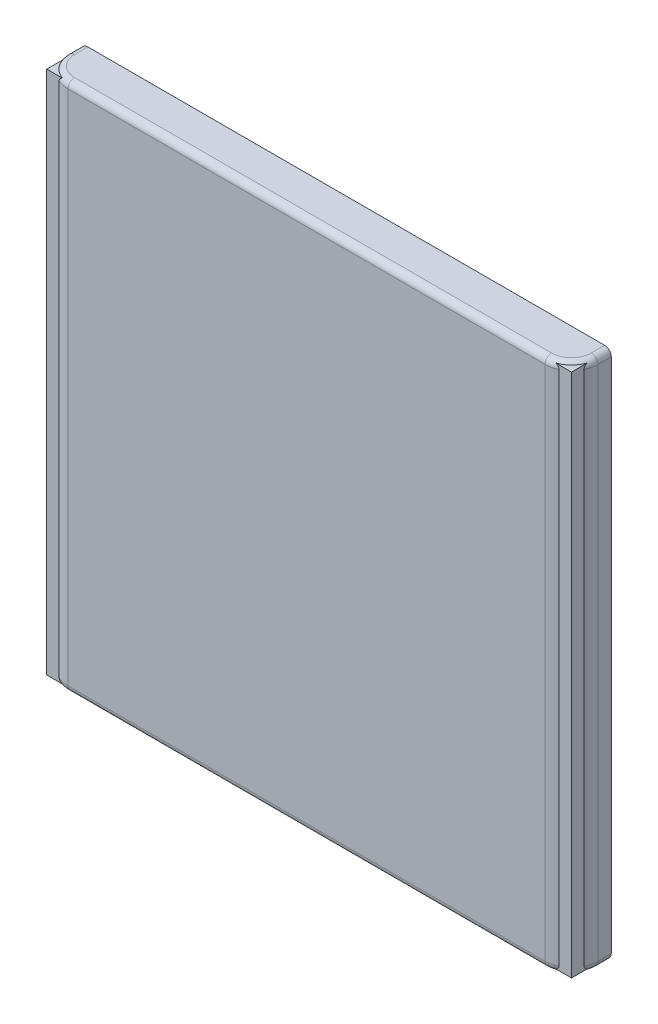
ISO-10303-21;
HEADER;
FILE_DESCRIPTION(('STEP AP214'),'2;1');
FILE_NAME('part.step','',(''),(''),'','','');
FILE_SCHEMA(('AUTOMOTIVE_DESIGN { 1 0 10303 214 1 1 1 1 }'));
ENDSEC;
DATA;
#1=APPLICATION_CONTEXT('core data for automotive mechanical design processes');
#2=APPLICATION_PROTOCOL_DEFINITION('international standard','automotive_design',2000,#1);
#3=PRODUCT_CONTEXT('',#1,'mechanical');
#4=PRODUCT('Part','Part','',(#3));
#5=PRODUCT_RELATED_PRODUCT_CATEGORY('part','',(#4));
#6=PRODUCT_DEFINITION_FORMATION('','',#4);
#7=PRODUCT_DEFINITION_CONTEXT('part definition',#1,'design');
#8=PRODUCT_DEFINITION('design','',#6,#7);
#9=PRODUCT_DEFINITION_SHAPE('','',#8);
#10=(LENGTH_UNIT() NAMED_UNIT(*) SI_UNIT(.MILLI.,.METRE.));
#11=(NAMED_UNIT(*) PLANE_ANGLE_UNIT() SI_UNIT($,.RADIAN.));
#12=(NAMED_UNIT(*) SI_UNIT($,.STERADIAN.) SOLID_ANGLE_UNIT());
#13=UNCERTAINTY_MEASURE_WITH_UNIT(LENGTH_MEASURE(1.E-05),#10,'distance_accuracy_value','');
#14=(GEOMETRIC_REPRESENTATION_CONTEXT(3) GLOBAL_UNCERTAINTY_ASSIGNED_CONTEXT((#13)) GLOBAL_UNIT_ASSIGNED_CONTEXT((#10,
#11,#12)) REPRESENTATION_CONTEXT('',''));
#15=CARTESIAN_POINT('',(0.,0.,0.));
#16=DIRECTION('',(0.,0.,1.));
#17=DIRECTION('',(1.,0.,0.));
#18=AXIS2_PLACEMENT_3D('',#15,#16,#17);
#19=CARTESIAN_POINT('',(0.,0.,0.));
#20=DIRECTION('',(0.,0.,-1.));
#21=DIRECTION('',(-1.,0.,0.));
#22=AXIS2_PLACEMENT_3D('',#19,#20,#21);
#23=PLANE('',#22);
#24=DIRECTION('',(1.,0.,0.));
#25=VECTOR('',#24,1.);
#26=CARTESIAN_POINT('',(0.,0.,0.));
#27=LINE('',#26,#25);
#28=CARTESIAN_POINT('',(5.,0.,0.));
#29=VERTEX_POINT('',#28);
#30=CARTESIAN_POINT('',(395.,0.,0.));
#31=VERTEX_POINT('',#30);
#32=EDGE_CURVE('E192',#29,#31,#27,.T.);
#33=ORIENTED_EDGE('',*,*,#32,.F.);
#34=CARTESIAN_POINT('',(5.,5.,0.));
#35=DIRECTION('',(0.,0.,-1.));
#36=DIRECTION('',(-1.,0.,0.));
#37=AXIS2_PLACEMENT_3D('',#34,#35,#36);
#38=CIRCLE('',#37,5.);
#39=CARTESIAN_POINT('',(0.,5.,0.));
#40=VERTEX_POINT('',#39);
#41=EDGE_CURVE('E247',#29,#40,#38,.T.);
#42=ORIENTED_EDGE('',*,*,#41,.T.);
#43=DIRECTION('',(0.,-1.,0.));
#44=VECTOR('',#43,1.);
#45=CARTESIAN_POINT('',(0.,0.,0.));
#46=LINE('',#45,#44);
#47=CARTESIAN_POINT('',(0.,395.,0.));
#48=VERTEX_POINT('',#47);
#49=EDGE_CURVE('E188',#48,#40,#46,.T.);
#50=ORIENTED_EDGE('',*,*,#49,.F.);
#51=CARTESIAN_POINT('',(5.,395.,0.));
#52=DIRECTION('',(0.,0.,-1.));
#53=DIRECTION('',(-1.,0.,0.));
#54=AXIS2_PLACEMENT_3D('',#51,#52,#53);
#55=CIRCLE('',#54,5.);
#56=CARTESIAN_POINT('',(5.,400.,0.));
#57=VERTEX_POINT('',#56);
#58=EDGE_CURVE('E241',#48,#57,#55,.T.);
#59=ORIENTED_EDGE('',*,*,#58,.T.);
#60=DIRECTION('',(-1.,0.,0.));
#61=VECTOR('',#60,1.);
#62=CARTESIAN_POINT('',(0.,400.,0.));
#63=LINE('',#62,#61);
#64=CARTESIAN_POINT('',(395.,400.,0.));
#65=VERTEX_POINT('',#64);
#66=EDGE_CURVE('E216',#65,#57,#63,.T.);
#67=ORIENTED_EDGE('',*,*,#66,.F.);
#68=CARTESIAN_POINT('',(395.,395.,0.));
#69=DIRECTION('',(0.,0.,-1.));
#70=DIRECTION('',(-1.,0.,0.));
#71=AXIS2_PLACEMENT_3D('',#68,#69,#70);
#72=CIRCLE('',#71,5.);
#73=CARTESIAN_POINT('',(400.,395.,0.));
#74=VERTEX_POINT('',#73);
#75=EDGE_CURVE('E243',#65,#74,#72,.T.);
#76=ORIENTED_EDGE('',*,*,#75,.T.);
#77=DIRECTION('',(0.,1.,0.));
#78=VECTOR('',#77,1.);
#79=CARTESIAN_POINT('',(400.,0.,0.));
#80=LINE('',#79,#78);
#81=CARTESIAN_POINT('',(400.,5.,0.));
#82=VERTEX_POINT('',#81);
#83=EDGE_CURVE('E213',#82,#74,#80,.T.);
#84=ORIENTED_EDGE('',*,*,#83,.F.);
#85=CARTESIAN_POINT('',(395.,5.,0.));
#86=DIRECTION('',(0.,0.,-1.));
#87=DIRECTION('',(-1.,0.,0.));
#88=AXIS2_PLACEMENT_3D('',#85,#86,#87);
#89=CIRCLE('',#88,5.);
#90=EDGE_CURVE('E245',#82,#31,#89,.T.);
#91=ORIENTED_EDGE('',*,*,#90,.T.);
#92=EDGE_LOOP('',(#33,#42,#50,#59,#67,#76,#84,#91));
#93=FACE_BOUND('',#92,.T.);
#94=DIRECTION('',(-1.,0.,0.));
#95=VECTOR('',#94,1.);
#96=CARTESIAN_POINT('',(0.,398.,0.));
#97=LINE('',#96,#95);
#98=CARTESIAN_POINT('',(398.,398.,0.));
#99=VERTEX_POINT('',#98);
#100=CARTESIAN_POINT('',(2.,398.,0.));
#101=VERTEX_POINT('',#100);
#102=EDGE_CURVE('E183',#99,#101,#97,.T.);
#103=ORIENTED_EDGE('',*,*,#102,.T.);
#104=DIRECTION('',(0.,-1.,0.));
#105=VECTOR('',#104,1.);
#106=CARTESIAN_POINT('',(2.,0.,0.));
#107=LINE('',#106,#105);
#108=CARTESIAN_POINT('',(2.,2.,0.));
#109=VERTEX_POINT('',#108);
#110=EDGE_CURVE('E202',#101,#109,#107,.T.);
#111=ORIENTED_EDGE('',*,*,#110,.T.);
#112=DIRECTION('',(1.,0.,0.));
#113=VECTOR('',#112,1.);
#114=CARTESIAN_POINT('',(0.,2.,0.));
#115=LINE('',#114,#113);
#116=CARTESIAN_POINT('',(398.,2.,0.));
#117=VERTEX_POINT('',#116);
#118=EDGE_CURVE('E187',#109,#117,#115,.T.);
#119=ORIENTED_EDGE('',*,*,#118,.T.);
#120=DIRECTION('',(0.,1.,0.));
#121=VECTOR('',#120,1.);
#122=CARTESIAN_POINT('',(398.,0.,0.));
#123=LINE('',#122,#121);
#124=EDGE_CURVE('E207',#117,#99,#123,.T.);
#125=ORIENTED_EDGE('',*,*,#124,.T.);
#126=EDGE_LOOP('',(#103,#111,#119,#125));
#127=FACE_BOUND('',#126,.T.);
#128=ADVANCED_FACE('F49',(#93,#127),#23,.T.);
#129=CARTESIAN_POINT('',(0.,0.,30.));
#130=DIRECTION('',(1.,0.,0.));
#131=DIRECTION('',(0.,0.,-1.));
#132=AXIS2_PLACEMENT_3D('',#129,#130,#131);
#133=PLANE('',#132);
#134=ORIENTED_EDGE('',*,*,#49,.T.);
#135=DIRECTION('',(0.,0.,-1.));
#136=VECTOR('',#135,1.);
#137=CARTESIAN_POINT('',(0.,5.,30.));
#138=LINE('',#137,#136);
#139=CARTESIAN_POINT('',(0.,5.,10.));
#140=VERTEX_POINT('',#139);
#141=EDGE_CURVE('E251',#40,#140,#138,.F.);
#142=ORIENTED_EDGE('',*,*,#141,.T.);
#143=DIRECTION('',(0.,-1.,0.));
#144=VECTOR('',#143,1.);
#145=CARTESIAN_POINT('',(0.,0.,10.));
#146=LINE('',#145,#144);
#147=CARTESIAN_POINT('',(0.,395.,10.));
#148=VERTEX_POINT('',#147);
#149=EDGE_CURVE('E227',#140,#148,#146,.F.);
#150=ORIENTED_EDGE('',*,*,#149,.T.);
#151=DIRECTION('',(0.,0.,-1.));
#152=VECTOR('',#151,1.);
#153=CARTESIAN_POINT('',(0.,395.,30.));
#154=LINE('',#153,#152);
#155=EDGE_CURVE('E249',#148,#48,#154,.T.);
#156=ORIENTED_EDGE('',*,*,#155,.T.);
#157=EDGE_LOOP('',(#134,#142,#150,#156));
#158=FACE_BOUND('',#157,.T.);
#159=ADVANCED_FACE('F306',(#158),#133,.F.);
#160=CARTESIAN_POINT('',(0.,0.,30.));
#161=DIRECTION('',(0.,1.,0.));
#162=DIRECTION('',(0.,0.,1.));
#163=AXIS2_PLACEMENT_3D('',#160,#161,#162);
#164=PLANE('',#163);
#165=CARTESIAN_POINT('',(20.,0.,10.));
#166=DIRECTION('',(0.,1.,0.));
#167=DIRECTION('',(0.,0.,1.));
#168=AXIS2_PLACEMENT_3D('',#165,#166,#167);
#169=CIRCLE('',#168,15.);
#170=CARTESIAN_POINT('',(20.,0.,25.));
#171=VERTEX_POINT('',#170);
#172=CARTESIAN_POINT('',(5.,0.,10.));
#173=VERTEX_POINT('',#172);
#174=EDGE_CURVE('E236',#171,#173,#169,.F.);
#175=ORIENTED_EDGE('',*,*,#174,.T.);
#176=DIRECTION('',(0.,0.,-1.));
#177=VECTOR('',#176,1.);
#178=CARTESIAN_POINT('',(5.,0.,30.));
#179=LINE('',#178,#177);
#180=EDGE_CURVE('E238',#173,#29,#179,.T.);
#181=ORIENTED_EDGE('',*,*,#180,.T.);
#182=ORIENTED_EDGE('',*,*,#32,.T.);
#183=DIRECTION('',(0.,0.,-1.));
#184=VECTOR('',#183,1.);
#185=CARTESIAN_POINT('',(395.,0.,30.));
#186=LINE('',#185,#184);
#187=CARTESIAN_POINT('',(395.,0.,10.));
#188=VERTEX_POINT('',#187);
#189=EDGE_CURVE('E234',#31,#188,#186,.F.);
#190=ORIENTED_EDGE('',*,*,#189,.T.);
#191=CARTESIAN_POINT('',(380.,0.,10.));
#192=DIRECTION('',(0.,1.,0.));
#193=DIRECTION('',(0.,0.,1.));
#194=AXIS2_PLACEMENT_3D('',#191,#192,#193);
#195=CIRCLE('',#194,15.);
#196=CARTESIAN_POINT('',(380.,0.,25.));
#197=VERTEX_POINT('',#196);
#198=EDGE_CURVE('E232',#188,#197,#195,.F.);
#199=ORIENTED_EDGE('',*,*,#198,.T.);
#200=DIRECTION('',(1.,0.,0.));
#201=VECTOR('',#200,1.);
#202=CARTESIAN_POINT('',(0.,0.,25.));
#203=LINE('',#202,#201);
#204=EDGE_CURVE('E230',#197,#171,#203,.F.);
#205=ORIENTED_EDGE('',*,*,#204,.T.);
#206=EDGE_LOOP('',(#175,#181,#182,#190,#199,#205));
#207=FACE_BOUND('',#206,.T.);
#208=ADVANCED_FACE('F317',(#207),#164,.F.);
#209=CARTESIAN_POINT('',(400.,0.,30.));
#210=DIRECTION('',(-1.,0.,0.));
#211=DIRECTION('',(0.,0.,1.));
#212=AXIS2_PLACEMENT_3D('',#209,#210,#211);
#213=PLANE('',#212);
#214=DIRECTION('',(0.,1.,0.));
#215=VECTOR('',#214,1.);
#216=CARTESIAN_POINT('',(400.,0.,10.));
#217=LINE('',#216,#215);
#218=CARTESIAN_POINT('',(400.,395.,10.));
#219=VERTEX_POINT('',#218);
#220=CARTESIAN_POINT('',(400.,5.,10.));
#221=VERTEX_POINT('',#220);
#222=EDGE_CURVE('E224',#219,#221,#217,.F.);
#223=ORIENTED_EDGE('',*,*,#222,.T.);
#224=DIRECTION('',(0.,0.,-1.));
#225=VECTOR('',#224,1.);
#226=CARTESIAN_POINT('',(400.,5.,30.));
#227=LINE('',#226,#225);
#228=EDGE_CURVE('E259',#221,#82,#227,.T.);
#229=ORIENTED_EDGE('',*,*,#228,.T.);
#230=ORIENTED_EDGE('',*,*,#83,.T.);
#231=DIRECTION('',(0.,0.,-1.));
#232=VECTOR('',#231,1.);
#233=CARTESIAN_POINT('',(400.,395.,30.));
#234=LINE('',#233,#232);
#235=EDGE_CURVE('E257',#74,#219,#234,.F.);
#236=ORIENTED_EDGE('',*,*,#235,.T.);
#237=EDGE_LOOP('',(#223,#229,#230,#236));
#238=FACE_BOUND('',#237,.T.);
#239=ADVANCED_FACE('F347',(#238),#213,.F.);
#240=CARTESIAN_POINT('',(0.,400.,30.));
#241=DIRECTION('',(0.,-1.,0.));
#242=DIRECTION('',(0.,0.,-1.));
#243=AXIS2_PLACEMENT_3D('',#240,#241,#242);
#244=PLANE('',#243);
#245=CARTESIAN_POINT('',(380.,400.,10.));
#246=DIRECTION('',(0.,-1.,0.));
#247=DIRECTION('',(0.,0.,-1.));
#248=AXIS2_PLACEMENT_3D('',#245,#246,#247);
#249=CIRCLE('',#248,15.);
#250=CARTESIAN_POINT('',(380.,400.,25.));
#251=VERTEX_POINT('',#250);
#252=CARTESIAN_POINT('',(395.,400.,10.));
#253=VERTEX_POINT('',#252);
#254=EDGE_CURVE('E66',#251,#253,#249,.F.);
#255=ORIENTED_EDGE('',*,*,#254,.T.);
#256=DIRECTION('',(0.,0.,-1.));
#257=VECTOR('',#256,1.);
#258=CARTESIAN_POINT('',(395.,400.,30.));
#259=LINE('',#258,#257);
#260=EDGE_CURVE('E271',#253,#65,#259,.T.);
#261=ORIENTED_EDGE('',*,*,#260,.T.);
#262=ORIENTED_EDGE('',*,*,#66,.T.);
#263=DIRECTION('',(0.,0.,-1.));
#264=VECTOR('',#263,1.);
#265=CARTESIAN_POINT('',(5.,400.,30.));
#266=LINE('',#265,#264);
#267=CARTESIAN_POINT('',(5.,400.,10.));
#268=VERTEX_POINT('',#267);
#269=EDGE_CURVE('E73',#57,#268,#266,.F.);
#270=ORIENTED_EDGE('',*,*,#269,.T.);
#271=CARTESIAN_POINT('',(20.,400.,10.));
#272=DIRECTION('',(0.,-1.,0.));
#273=DIRECTION('',(0.,0.,-1.));
#274=AXIS2_PLACEMENT_3D('',#271,#272,#273);
#275=CIRCLE('',#274,15.);
#276=CARTESIAN_POINT('',(20.,400.,25.));
#277=VERTEX_POINT('',#276);
#278=EDGE_CURVE('E267',#268,#277,#275,.F.);
#279=ORIENTED_EDGE('',*,*,#278,.T.);
#280=DIRECTION('',(-1.,0.,0.));
#281=VECTOR('',#280,1.);
#282=CARTESIAN_POINT('',(0.,400.,25.));
#283=LINE('',#282,#281);
#284=EDGE_CURVE('E265',#277,#251,#283,.F.);
#285=ORIENTED_EDGE('',*,*,#284,.T.);
#286=EDGE_LOOP('',(#255,#261,#262,#270,#279,#285));
#287=FACE_BOUND('',#286,.T.);
#288=ADVANCED_FACE('F360',(#287),#244,.F.);
#289=CARTESIAN_POINT('',(0.,0.,30.));
#290=DIRECTION('',(0.,0.,-1.));
#291=DIRECTION('',(-1.,0.,0.));
#292=AXIS2_PLACEMENT_3D('',#289,#290,#291);
#293=PLANE('',#292);
#294=DIRECTION('',(0.,-1.,0.));
#295=VECTOR('',#294,1.);
#296=CARTESIAN_POINT('',(20.,0.,30.));
#297=LINE('',#296,#295);
#298=CARTESIAN_POINT('',(20.,395.,30.));
#299=VERTEX_POINT('',#298);
#300=CARTESIAN_POINT('',(20.,5.,30.));
#301=VERTEX_POINT('',#300);
#302=EDGE_CURVE('E218',#299,#301,#297,.T.);
#303=ORIENTED_EDGE('',*,*,#302,.T.);
#304=DIRECTION('',(1.,0.,0.));
#305=VECTOR('',#304,1.);
#306=CARTESIAN_POINT('',(0.,5.,30.));
#307=LINE('',#306,#305);
#308=CARTESIAN_POINT('',(380.,5.,30.));
#309=VERTEX_POINT('',#308);
#310=EDGE_CURVE('E11',#301,#309,#307,.T.);
#311=ORIENTED_EDGE('',*,*,#310,.T.);
#312=DIRECTION('',(0.,1.,0.));
#313=VECTOR('',#312,1.);
#314=CARTESIAN_POINT('',(380.,0.,30.));
#315=LINE('',#314,#313);
#316=CARTESIAN_POINT('',(380.,395.,30.));
#317=VERTEX_POINT('',#316);
#318=EDGE_CURVE('E221',#309,#317,#315,.T.);
#319=ORIENTED_EDGE('',*,*,#318,.T.);
#320=DIRECTION('',(-1.,0.,0.));
#321=VECTOR('',#320,1.);
#322=CARTESIAN_POINT('',(0.,395.,30.));
#323=LINE('',#322,#321);
#324=EDGE_CURVE('E58',#317,#299,#323,.T.);
#325=ORIENTED_EDGE('',*,*,#324,.T.);
#326=EDGE_LOOP('',(#303,#311,#319,#325));
#327=FACE_BOUND('',#326,.T.);
#328=ADVANCED_FACE('F331',(#327),#293,.F.);
#329=CARTESIAN_POINT('',(2.,0.,30.));
#330=DIRECTION('',(1.,0.,0.));
#331=DIRECTION('',(0.,0.,-1.));
#332=AXIS2_PLACEMENT_3D('',#329,#330,#331);
#333=PLANE('',#332);
#334=ORIENTED_EDGE('',*,*,#110,.F.);
#335=DIRECTION('',(0.,0.,-1.));
#336=VECTOR('',#335,1.);
#337=CARTESIAN_POINT('',(2.,398.,30.));
#338=LINE('',#337,#336);
#339=CARTESIAN_POINT('',(2.,398.,28.));
#340=VERTEX_POINT('',#339);
#341=EDGE_CURVE('E182',#340,#101,#338,.T.);
#342=ORIENTED_EDGE('',*,*,#341,.F.);
#343=DIRECTION('',(0.,-1.,0.));
#344=VECTOR('',#343,1.);
#345=CARTESIAN_POINT('',(2.,0.,28.));
#346=LINE('',#345,#344);
#347=CARTESIAN_POINT('',(2.,2.,28.));
#348=VERTEX_POINT('',#347);
#349=EDGE_CURVE('E168',#340,#348,#346,.T.);
#350=ORIENTED_EDGE('',*,*,#349,.T.);
#351=DIRECTION('',(0.,0.,-1.));
#352=VECTOR('',#351,1.);
#353=CARTESIAN_POINT('',(2.,2.,30.));
#354=LINE('',#353,#352);
#355=EDGE_CURVE('E180',#348,#109,#354,.T.);
#356=ORIENTED_EDGE('',*,*,#355,.T.);
#357=EDGE_LOOP('',(#334,#342,#350,#356));
#358=FACE_BOUND('',#357,.T.);
#359=ADVANCED_FACE('F179',(#358),#333,.T.);
#360=CARTESIAN_POINT('',(0.,2.,30.));
#361=DIRECTION('',(0.,1.,0.));
#362=DIRECTION('',(0.,0.,1.));
#363=AXIS2_PLACEMENT_3D('',#360,#361,#362);
#364=PLANE('',#363);
#365=ORIENTED_EDGE('',*,*,#118,.F.);
#366=ORIENTED_EDGE('',*,*,#355,.F.);
#367=DIRECTION('',(1.,0.,0.));
#368=VECTOR('',#367,1.);
#369=CARTESIAN_POINT('',(0.,2.,28.));
#370=LINE('',#369,#368);
#371=CARTESIAN_POINT('',(398.,2.,28.));
#372=VERTEX_POINT('',#371);
#373=EDGE_CURVE('E164',#348,#372,#370,.T.);
#374=ORIENTED_EDGE('',*,*,#373,.T.);
#375=DIRECTION('',(0.,0.,-1.));
#376=VECTOR('',#375,1.);
#377=CARTESIAN_POINT('',(398.,2.,30.));
#378=LINE('',#377,#376);
#379=EDGE_CURVE('E189',#372,#117,#378,.T.);
#380=ORIENTED_EDGE('',*,*,#379,.T.);
#381=EDGE_LOOP('',(#365,#366,#374,#380));
#382=FACE_BOUND('',#381,.T.);
#383=ADVANCED_FACE('F185',(#382),#364,.T.);
#384=CARTESIAN_POINT('',(398.,0.,30.));
#385=DIRECTION('',(-1.,0.,0.));
#386=DIRECTION('',(0.,0.,1.));
#387=AXIS2_PLACEMENT_3D('',#384,#385,#386);
#388=PLANE('',#387);
#389=ORIENTED_EDGE('',*,*,#124,.F.);
#390=ORIENTED_EDGE('',*,*,#379,.F.);
#391=DIRECTION('',(0.,1.,0.));
#392=VECTOR('',#391,1.);
#393=CARTESIAN_POINT('',(398.,0.,28.));
#394=LINE('',#393,#392);
#395=CARTESIAN_POINT('',(398.,398.,28.));
#396=VERTEX_POINT('',#395);
#397=EDGE_CURVE('E169',#372,#396,#394,.T.);
#398=ORIENTED_EDGE('',*,*,#397,.T.);
#399=DIRECTION('',(0.,0.,-1.));
#400=VECTOR('',#399,1.);
#401=CARTESIAN_POINT('',(398.,398.,30.));
#402=LINE('',#401,#400);
#403=EDGE_CURVE('E194',#396,#99,#402,.T.);
#404=ORIENTED_EDGE('',*,*,#403,.T.);
#405=EDGE_LOOP('',(#389,#390,#398,#404));
#406=FACE_BOUND('',#405,.T.);
#407=ADVANCED_FACE('F381',(#406),#388,.T.);
#408=CARTESIAN_POINT('',(0.,398.,30.));
#409=DIRECTION('',(0.,-1.,0.));
#410=DIRECTION('',(0.,0.,-1.));
#411=AXIS2_PLACEMENT_3D('',#408,#409,#410);
#412=PLANE('',#411);
#413=ORIENTED_EDGE('',*,*,#102,.F.);
#414=ORIENTED_EDGE('',*,*,#403,.F.);
#415=DIRECTION('',(-1.,0.,0.));
#416=VECTOR('',#415,1.);
#417=CARTESIAN_POINT('',(0.,398.,28.));
#418=LINE('',#417,#416);
#419=EDGE_CURVE('E197',#396,#340,#418,.T.);
#420=ORIENTED_EDGE('',*,*,#419,.T.);
#421=ORIENTED_EDGE('',*,*,#341,.T.);
#422=EDGE_LOOP('',(#413,#414,#420,#421));
#423=FACE_BOUND('',#422,.T.);
#424=ADVANCED_FACE('F378',(#423),#412,.T.);
#425=CARTESIAN_POINT('',(0.,0.,28.));
#426=DIRECTION('',(0.,0.,-1.));
#427=DIRECTION('',(-1.,0.,0.));
#428=AXIS2_PLACEMENT_3D('',#425,#426,#427);
#429=PLANE('',#428);
#430=ORIENTED_EDGE('',*,*,#349,.F.);
#431=ORIENTED_EDGE('',*,*,#419,.F.);
#432=ORIENTED_EDGE('',*,*,#397,.F.);
#433=ORIENTED_EDGE('',*,*,#373,.F.);
#434=EDGE_LOOP('',(#430,#431,#432,#433));
#435=FACE_BOUND('',#434,.T.);
#436=ADVANCED_FACE('F166',(#435),#429,.T.);
#437=CARTESIAN_POINT('',(380.,0.,10.));
#438=DIRECTION('',(0.,1.,0.));
#439=DIRECTION('',(0.,0.,1.));
#440=AXIS2_PLACEMENT_3D('',#437,#438,#439);
#441=CYLINDRICAL_SURFACE('',#440,20.);
#442=ORIENTED_EDGE('',*,*,#318,.F.);
#443=CARTESIAN_POINT('',(380.,5.,10.));
#444=DIRECTION('',(0.,1.,0.));
#445=DIRECTION('',(0.,0.,1.));
#446=AXIS2_PLACEMENT_3D('',#443,#444,#445);
#447=CIRCLE('',#446,20.);
#448=EDGE_CURVE('E263',#309,#221,#447,.T.);
#449=ORIENTED_EDGE('',*,*,#448,.T.);
#450=ORIENTED_EDGE('',*,*,#222,.F.);
#451=CARTESIAN_POINT('',(380.,395.,10.));
#452=DIRECTION('',(0.,-1.,0.));
#453=DIRECTION('',(0.,0.,-1.));
#454=AXIS2_PLACEMENT_3D('',#451,#452,#453);
#455=CIRCLE('',#454,20.);
#456=EDGE_CURVE('E261',#219,#317,#455,.T.);
#457=ORIENTED_EDGE('',*,*,#456,.T.);
#458=EDGE_LOOP('',(#442,#449,#450,#457));
#459=FACE_BOUND('',#458,.T.);
#460=ADVANCED_FACE('F343',(#459),#441,.T.);
#461=CARTESIAN_POINT('',(20.,0.,10.));
#462=DIRECTION('',(0.,-1.,0.));
#463=DIRECTION('',(0.,0.,-1.));
#464=AXIS2_PLACEMENT_3D('',#461,#462,#463);
#465=CYLINDRICAL_SURFACE('',#464,20.);
#466=ORIENTED_EDGE('',*,*,#149,.F.);
#467=CARTESIAN_POINT('',(20.,5.,10.));
#468=DIRECTION('',(0.,1.,0.));
#469=DIRECTION('',(0.,0.,1.));
#470=AXIS2_PLACEMENT_3D('',#467,#468,#469);
#471=CIRCLE('',#470,20.);
#472=EDGE_CURVE('E255',#140,#301,#471,.T.);
#473=ORIENTED_EDGE('',*,*,#472,.T.);
#474=ORIENTED_EDGE('',*,*,#302,.F.);
#475=CARTESIAN_POINT('',(20.,395.,10.));
#476=DIRECTION('',(0.,-1.,0.));
#477=DIRECTION('',(0.,0.,-1.));
#478=AXIS2_PLACEMENT_3D('',#475,#476,#477);
#479=CIRCLE('',#478,20.);
#480=EDGE_CURVE('E253',#299,#148,#479,.T.);
#481=ORIENTED_EDGE('',*,*,#480,.T.);
#482=EDGE_LOOP('',(#466,#473,#474,#481));
#483=FACE_BOUND('',#482,.T.);
#484=ADVANCED_FACE('F328',(#483),#465,.T.);
#485=CARTESIAN_POINT('',(395.,5.,30.));
#486=DIRECTION('',(0.,0.,-1.));
#487=DIRECTION('',(-1.,0.,0.));
#488=AXIS2_PLACEMENT_3D('',#485,#486,#487);
#489=CYLINDRICAL_SURFACE('',#488,5.);
#490=ORIENTED_EDGE('',*,*,#90,.F.);
#491=ORIENTED_EDGE('',*,*,#228,.F.);
#492=CARTESIAN_POINT('',(395.,5.,10.));
#493=DIRECTION('',(0.,0.,1.));
#494=DIRECTION('',(1.,0.,0.));
#495=AXIS2_PLACEMENT_3D('',#492,#493,#494);
#496=CIRCLE('',#495,5.);
#497=EDGE_CURVE('E204',#188,#221,#496,.T.);
#498=ORIENTED_EDGE('',*,*,#497,.F.);
#499=ORIENTED_EDGE('',*,*,#189,.F.);
#500=EDGE_LOOP('',(#490,#491,#498,#499));
#501=FACE_BOUND('',#500,.T.);
#502=ADVANCED_FACE('F352',(#501),#489,.T.);
#503=CARTESIAN_POINT('',(380.,5.,10.));
#504=DIRECTION('',(0.,1.,0.));
#505=DIRECTION('',(0.,0.,1.));
#506=AXIS2_PLACEMENT_3D('',#503,#504,#505);
#507=TOROIDAL_SURFACE('',#506,15.,5.);
#508=ORIENTED_EDGE('',*,*,#497,.T.);
#509=ORIENTED_EDGE('',*,*,#448,.F.);
#510=CARTESIAN_POINT('',(380.,5.,25.));
#511=DIRECTION('',(-1.,0.,0.));
#512=DIRECTION('',(0.,0.,1.));
#513=AXIS2_PLACEMENT_3D('',#510,#511,#512);
#514=CIRCLE('',#513,5.);
#515=EDGE_CURVE('E280',#197,#309,#514,.T.);
#516=ORIENTED_EDGE('',*,*,#515,.F.);
#517=ORIENTED_EDGE('',*,*,#198,.F.);
#518=EDGE_LOOP('',(#508,#509,#516,#517));
#519=FACE_BOUND('',#518,.T.);
#520=ADVANCED_FACE('F339',(#519),#507,.T.);
#521=CARTESIAN_POINT('',(0.,5.,25.));
#522=DIRECTION('',(1.,0.,0.));
#523=DIRECTION('',(0.,0.,-1.));
#524=AXIS2_PLACEMENT_3D('',#521,#522,#523);
#525=CYLINDRICAL_SURFACE('',#524,5.);
#526=ORIENTED_EDGE('',*,*,#515,.T.);
#527=ORIENTED_EDGE('',*,*,#310,.F.);
#528=CARTESIAN_POINT('',(20.,5.,25.));
#529=DIRECTION('',(-1.,0.,0.));
#530=DIRECTION('',(0.,0.,1.));
#531=AXIS2_PLACEMENT_3D('',#528,#529,#530);
#532=CIRCLE('',#531,5.);
#533=EDGE_CURVE('E277',#171,#301,#532,.T.);
#534=ORIENTED_EDGE('',*,*,#533,.F.);
#535=ORIENTED_EDGE('',*,*,#204,.F.);
#536=EDGE_LOOP('',(#526,#527,#534,#535));
#537=FACE_BOUND('',#536,.T.);
#538=ADVANCED_FACE('F334',(#537),#525,.T.);
#539=CARTESIAN_POINT('',(20.,5.,10.));
#540=DIRECTION('',(0.,1.,0.));
#541=DIRECTION('',(0.,0.,1.));
#542=AXIS2_PLACEMENT_3D('',#539,#540,#541);
#543=TOROIDAL_SURFACE('',#542,15.,5.);
#544=ORIENTED_EDGE('',*,*,#533,.T.);
#545=ORIENTED_EDGE('',*,*,#472,.F.);
#546=CARTESIAN_POINT('',(5.,5.,10.));
#547=DIRECTION('',(0.,0.,-1.));
#548=DIRECTION('',(-1.,0.,0.));
#549=AXIS2_PLACEMENT_3D('',#546,#547,#548);
#550=CIRCLE('',#549,5.);
#551=EDGE_CURVE('E274',#173,#140,#550,.T.);
#552=ORIENTED_EDGE('',*,*,#551,.F.);
#553=ORIENTED_EDGE('',*,*,#174,.F.);
#554=EDGE_LOOP('',(#544,#545,#552,#553));
#555=FACE_BOUND('',#554,.T.);
#556=ADVANCED_FACE('F325',(#555),#543,.T.);
#557=CARTESIAN_POINT('',(5.,5.,30.));
#558=DIRECTION('',(0.,0.,-1.));
#559=DIRECTION('',(-1.,0.,0.));
#560=AXIS2_PLACEMENT_3D('',#557,#558,#559);
#561=CYLINDRICAL_SURFACE('',#560,5.);
#562=ORIENTED_EDGE('',*,*,#551,.T.);
#563=ORIENTED_EDGE('',*,*,#141,.F.);
#564=ORIENTED_EDGE('',*,*,#41,.F.);
#565=ORIENTED_EDGE('',*,*,#180,.F.);
#566=EDGE_LOOP('',(#562,#563,#564,#565));
#567=FACE_BOUND('',#566,.T.);
#568=ADVANCED_FACE('F315',(#567),#561,.T.);
#569=CARTESIAN_POINT('',(5.,395.,30.));
#570=DIRECTION('',(0.,0.,-1.));
#571=DIRECTION('',(-1.,0.,0.));
#572=AXIS2_PLACEMENT_3D('',#569,#570,#571);
#573=CYLINDRICAL_SURFACE('',#572,5.);
#574=ORIENTED_EDGE('',*,*,#58,.F.);
#575=ORIENTED_EDGE('',*,*,#155,.F.);
#576=CARTESIAN_POINT('',(5.,395.,10.));
#577=DIRECTION('',(0.,0.,1.));
#578=DIRECTION('',(1.,0.,0.));
#579=AXIS2_PLACEMENT_3D('',#576,#577,#578);
#580=CIRCLE('',#579,5.);
#581=EDGE_CURVE('E53',#268,#148,#580,.T.);
#582=ORIENTED_EDGE('',*,*,#581,.F.);
#583=ORIENTED_EDGE('',*,*,#269,.F.);
#584=EDGE_LOOP('',(#574,#575,#582,#583));
#585=FACE_BOUND('',#584,.T.);
#586=ADVANCED_FACE('F51',(#585),#573,.T.);
#587=CARTESIAN_POINT('',(20.,395.,10.));
#588=DIRECTION('',(0.,-1.,0.));
#589=DIRECTION('',(0.,0.,-1.));
#590=AXIS2_PLACEMENT_3D('',#587,#588,#589);
#591=TOROIDAL_SURFACE('',#590,15.,5.);
#592=ORIENTED_EDGE('',*,*,#581,.T.);
#593=ORIENTED_EDGE('',*,*,#480,.F.);
#594=CARTESIAN_POINT('',(20.,395.,25.));
#595=DIRECTION('',(1.,0.,0.));
#596=DIRECTION('',(0.,0.,-1.));
#597=AXIS2_PLACEMENT_3D('',#594,#595,#596);
#598=CIRCLE('',#597,5.);
#599=EDGE_CURVE('E290',#277,#299,#598,.T.);
#600=ORIENTED_EDGE('',*,*,#599,.F.);
#601=ORIENTED_EDGE('',*,*,#278,.F.);
#602=EDGE_LOOP('',(#592,#593,#600,#601));
#603=FACE_BOUND('',#602,.T.);
#604=ADVANCED_FACE('F300',(#603),#591,.T.);
#605=CARTESIAN_POINT('',(0.,395.,25.));
#606=DIRECTION('',(-1.,0.,0.));
#607=DIRECTION('',(0.,0.,1.));
#608=AXIS2_PLACEMENT_3D('',#605,#606,#607);
#609=CYLINDRICAL_SURFACE('',#608,5.);
#610=ORIENTED_EDGE('',*,*,#599,.T.);
#611=ORIENTED_EDGE('',*,*,#324,.F.);
#612=CARTESIAN_POINT('',(380.,395.,25.));
#613=DIRECTION('',(1.,0.,0.));
#614=DIRECTION('',(0.,0.,-1.));
#615=AXIS2_PLACEMENT_3D('',#612,#613,#614);
#616=CIRCLE('',#615,5.);
#617=EDGE_CURVE('E288',#251,#317,#616,.T.);
#618=ORIENTED_EDGE('',*,*,#617,.F.);
#619=ORIENTED_EDGE('',*,*,#284,.F.);
#620=EDGE_LOOP('',(#610,#611,#618,#619));
#621=FACE_BOUND('',#620,.T.);
#622=ADVANCED_FACE('F359',(#621),#609,.T.);
#623=CARTESIAN_POINT('',(380.,395.,10.));
#624=DIRECTION('',(0.,-1.,0.));
#625=DIRECTION('',(0.,0.,-1.));
#626=AXIS2_PLACEMENT_3D('',#623,#624,#625);
#627=TOROIDAL_SURFACE('',#626,15.,5.);
#628=ORIENTED_EDGE('',*,*,#617,.T.);
#629=ORIENTED_EDGE('',*,*,#456,.F.);
#630=CARTESIAN_POINT('',(395.,395.,10.));
#631=DIRECTION('',(0.,0.,-1.));
#632=DIRECTION('',(-1.,0.,0.));
#633=AXIS2_PLACEMENT_3D('',#630,#631,#632);
#634=CIRCLE('',#633,5.);
#635=EDGE_CURVE('E285',#253,#219,#634,.T.);
#636=ORIENTED_EDGE('',*,*,#635,.F.);
#637=ORIENTED_EDGE('',*,*,#254,.F.);
#638=EDGE_LOOP('',(#628,#629,#636,#637));
#639=FACE_BOUND('',#638,.T.);
#640=ADVANCED_FACE('F357',(#639),#627,.T.);
#641=CARTESIAN_POINT('',(395.,395.,30.));
#642=DIRECTION('',(0.,0.,-1.));
#643=DIRECTION('',(-1.,0.,0.));
#644=AXIS2_PLACEMENT_3D('',#641,#642,#643);
#645=CYLINDRICAL_SURFACE('',#644,5.);
#646=ORIENTED_EDGE('',*,*,#635,.T.);
#647=ORIENTED_EDGE('',*,*,#235,.F.);
#648=ORIENTED_EDGE('',*,*,#75,.F.);
#649=ORIENTED_EDGE('',*,*,#260,.F.);
#650=EDGE_LOOP('',(#646,#647,#648,#649));
#651=FACE_BOUND('',#650,.T.);
#652=ADVANCED_FACE('F354',(#651),#645,.T.);
#653=CLOSED_SHELL('',(#128,#159,#208,#239,#288,#328,#359,#383,#407,#424,#436,#460,#484,#502,
#520,#538,#556,#568,#586,#604,#622,#640,#652));
#654=MANIFOLD_SOLID_BREP('B2',#653);
#655=ADVANCED_BREP_SHAPE_REPRESENTATION('',(#18,#654),#14);
#656=SHAPE_DEFINITION_REPRESENTATION(#9,#655);
ENDSEC;
END-ISO-10303-21;
